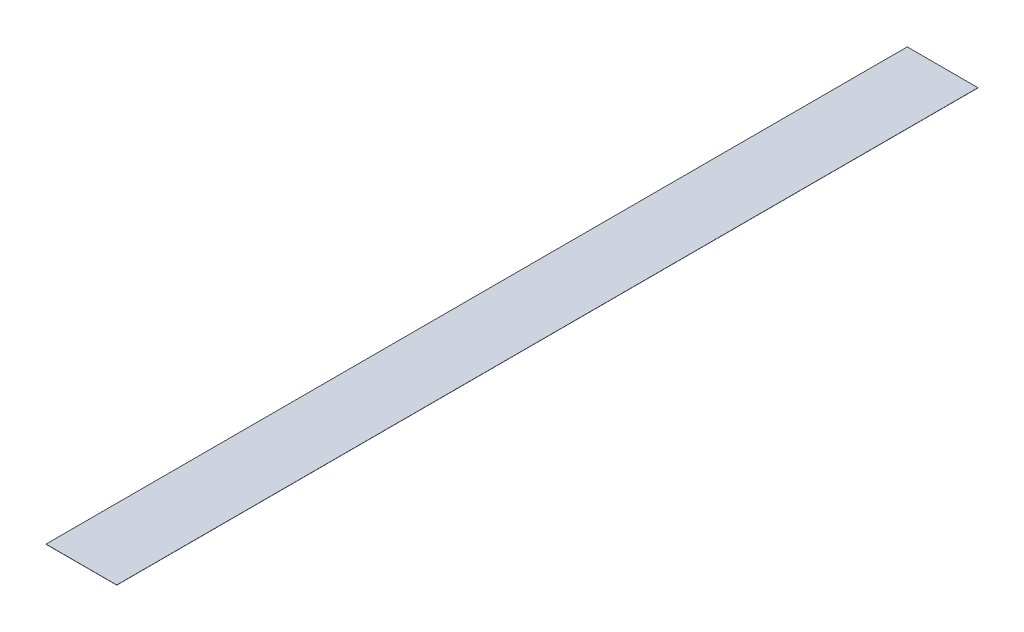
from build123d import *

# Parameters (mm, degrees)
SKETCH1_W      = 24.6054
SKETCH1_H      = 299.5
EXTRUDE1_DEPTH = 0.0508


with BuildPart() as part:
    # Sketch1 → Extrude1 (new body)
    with BuildSketch(Plane(origin=(0, 0, 0), x_dir=(1, 0, 0), z_dir=(0, 1, 0))):
        Rectangle(SKETCH1_W, SKETCH1_H)
    extrude(amount=EXTRUDE1_DEPTH)


solid = part.part
